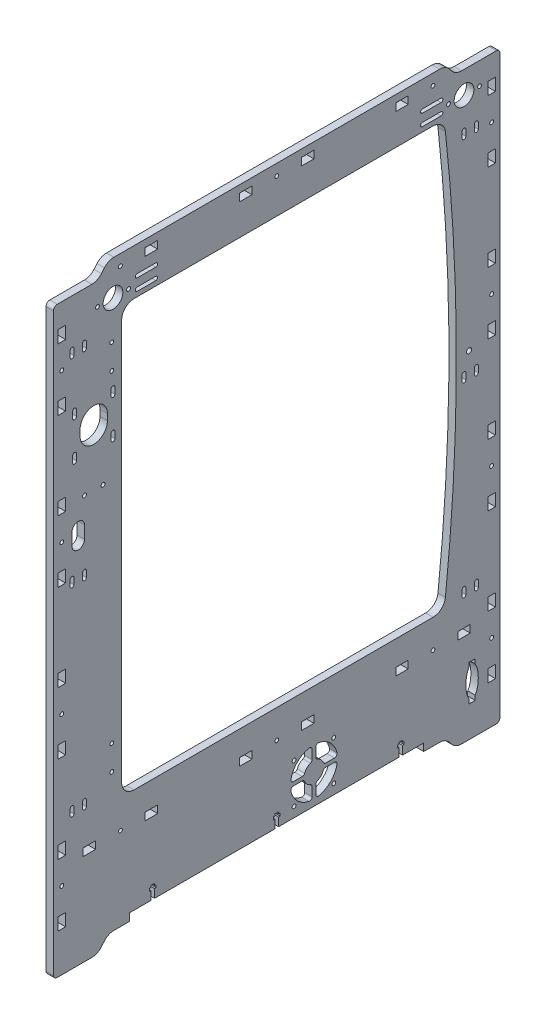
from build123d import *

# Parameters (mm, degrees)
SKETCH_1_R           = 1.55
SKETCH_1_R_2         = 7.95
SKETCH_1_W           = 10
SKETCH_1_H           = 6.1
SKETCH_1_W_2         = 6.1
SKETCH_1_H_2         = 10
EXTRUDE_1_DEPTH      = 6
SKETCH_2_W           = 5
SKETCH_2_H           = 29
CUT_EXTRUDE_1_DEPTH  = 513.675335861
CUT_EXTRUDE_3_DEPTH  = 513.675335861
CUT_EXTRUDE_4_DEPTH  = 513.675335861
SKETCH_7_W           = 237
SKETCH_7_H           = 6
CUT_EXTRUDE_6_DEPTH  = 513.675335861
SKETCH_8_R           = 1.55
CUT_EXTRUDE_7_DEPTH  = 513.675335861
FILLET_2_R           = 2
CUT_EXTRUDE_8_DEPTH  = 513.675335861
CUT_EXTRUDE_9_DEPTH  = 513.675335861
CUT_EXTRUDE_10_DEPTH = 513.675335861
CUT_EXTRUDE_11_DEPTH = 513.675335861
CUT_EXTRUDE_12_DEPTH = 513.675335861
SKETCH_14_RX         = 12.5
SKETCH_14_RY         = 5
CUT_EXTRUDE_13_DEPTH = 513.675335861
SKETCH_15_R          = 1.6
CUT_EXTRUDE_14_DEPTH = 513.675335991
SKETCH_16_R          = 1.55
SKETCH_16_R_2        = 2.05
CUT_EXTRUDE_15_DEPTH = 513.675335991


with BuildPart() as part:
    # Sketch 1 → Extrude 1 (new body)
    with BuildSketch(Plane(origin=(0, 0, 0), x_dir=(0, -1, 0), z_dir=(-1, 0, 0))):
        with BuildLine():
            Line((-473.572123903, -141.339555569), (-476.427876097, -138.943294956))
            ThreePointArc((-476.427876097, -138.943294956), (-479.06307787, -135.509033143), (-480, -131.282850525))
            Line((-480, -131.282850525), (-480, 131.282850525))
            ThreePointArc((-480, 131.282850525), (-479.06307787, 135.509033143), (-476.427876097, 138.943294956))
            Line((-476.427876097, 138.943294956), (-473.572123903, 141.339555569))
            ThreePointArc((-473.572123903, 141.339555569), (-470.93692213, 144.773817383), (-470, 149))
            Line((-470, 149), (-470, 177))
            ThreePointArc((-470, 177), (-469.121320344, 179.121320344), (-467, 180))
            Line((-467, 180), (-3, 180))
            ThreePointArc((-3, 180), (-0.878679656, 179.121320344), (0, 177))
            Line((0, 177), (0, 149))
            ThreePointArc((0, 149), (-0.93692213, 144.773817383), (-3.572123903, 141.339555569))
            Line((-3.572123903, 141.339555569), (-6.427876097, 138.943294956))
            ThreePointArc((-6.427876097, 138.943294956), (-9.06307787, 135.509033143), (-10, 131.282850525))
            Line((-10, 131.282850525), (-10, -131.282850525))
            ThreePointArc((-10, -131.282850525), (-9.06307787, -135.509033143), (-6.427876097, -138.943294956))
            Line((-6.427876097, -138.943294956), (-3.572123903, -141.339555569))
            ThreePointArc((-3.572123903, -141.339555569), (-0.93692213, -144.773817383), (0, -149))
            Line((0, -149), (0, -177))
            ThreePointArc((0, -177), (-0.878679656, -179.121320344), (-3, -180))
            Line((-3, -180), (-467, -180))
            ThreePointArc((-467, -180), (-469.121320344, -179.121320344), (-470, -177))
            Line((-470, -177), (-470, -149))
            ThreePointArc((-470, -149), (-470.93692213, -144.773817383), (-473.572123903, -141.339555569))
        make_face()
        with Locations(Location((-302, 173.25, 0), (0, 0, 90))):
            Circle(SKETCH_1_R, mode=Mode.SUBTRACT)
        with Locations(Location((-62, -173.25, 0), (0, 0, 90))):
            Circle(SKETCH_1_R, mode=Mode.SUBTRACT)
        with Locations(Location((-452, 132, 0), (0, 0, 90))):
            Circle(SKETCH_1_R_2, mode=Mode.SUBTRACT)
        with Locations(Location((-452, 119.5, 0), (0, 0, 90))):
            Circle(SKETCH_1_R, mode=Mode.SUBTRACT)
        with Locations(Location((-182, 173.25, 0), (0, 0, 90))):
            Circle(SKETCH_1_R, mode=Mode.SUBTRACT)
        with Locations(Location((-452, -163.5, 0), (0, 0, 90))):
            Circle(SKETCH_1_R, mode=Mode.SUBTRACT)
        with Locations(Location((-452, -138.5, 0), (0, 0, 90))):
            Circle(SKETCH_1_R, mode=Mode.SUBTRACT)
        with Locations(Location((-452, -151, 0), (0, 0, 90))):
            Circle(SKETCH_1_R_2, mode=Mode.SUBTRACT)
        with Locations(Location((-422, 173.25, 0), (0, 0, 90))):
            Circle(SKETCH_1_R, mode=Mode.SUBTRACT)
        with Locations(Location((-77, 0, 0), (0, 0, 90))):
            Circle(SKETCH_1_R, mode=Mode.SUBTRACT)
        with Locations(Location((-77, 126, 0), (0, 0, 90))):
            Circle(SKETCH_1_R, mode=Mode.SUBTRACT)
        with Locations(Location((-471.1, 126, 0), (0, 0, 90))):
            Circle(SKETCH_1_R, mode=Mode.SUBTRACT)
        with Locations(Location((-471.1, 0, 0), (0, 0, 90))):
            Circle(SKETCH_1_R, mode=Mode.SUBTRACT)
        with Locations(Location((-471.1, -126, 0), (0, 0, 90))):
            Circle(SKETCH_1_R, mode=Mode.SUBTRACT)
        with Locations(Location((-77, -126, 0), (0, 0, 90))):
            Circle(SKETCH_1_R, mode=Mode.SUBTRACT)
        with Locations(Location((-422, -173.25, 0), (0, 0, 90))):
            Circle(SKETCH_1_R, mode=Mode.SUBTRACT)
        with Locations(Location((-182, -173.25, 0), (0, 0, 90))):
            Circle(SKETCH_1_R, mode=Mode.SUBTRACT)
        with Locations(Location((-452, 144.5, 0), (0, 0, 90))):
            Circle(SKETCH_1_R, mode=Mode.SUBTRACT)
        with Locations(Location((-302, -173.25, 0), (0, 0, 90))):
            Circle(SKETCH_1_R, mode=Mode.SUBTRACT)
        with Locations(Location((-62, 173.25, 0), (0, 0, 90))):
            Circle(SKETCH_1_R, mode=Mode.SUBTRACT)
        with Locations((-37, -173.25)):
            Rectangle(SKETCH_1_W, SKETCH_1_H, mode=Mode.SUBTRACT)
        with Locations((-397, 173.25)):
            Rectangle(SKETCH_1_W, SKETCH_1_H, mode=Mode.SUBTRACT)
        with Locations((-327, 173.25)):
            Rectangle(SKETCH_1_W, SKETCH_1_H, mode=Mode.SUBTRACT)
        with Locations((-277, 173.25)):
            Rectangle(SKETCH_1_W, SKETCH_1_H, mode=Mode.SUBTRACT)
        with Locations((-207, 173.25)):
            Rectangle(SKETCH_1_W, SKETCH_1_H, mode=Mode.SUBTRACT)
        with Locations((-157, 173.25)):
            Rectangle(SKETCH_1_W, SKETCH_1_H, mode=Mode.SUBTRACT)
        with Locations((-471.1, -25)):
            Rectangle(SKETCH_1_W_2, SKETCH_1_H_2, mode=Mode.SUBTRACT)
        with Locations((-447, 173.25)):
            Rectangle(SKETCH_1_W, SKETCH_1_H, mode=Mode.SUBTRACT)
        with Locations((-471.1, -101)):
            Rectangle(SKETCH_1_W_2, SKETCH_1_H_2, mode=Mode.SUBTRACT)
        with Locations((-77, -151)):
            Rectangle(SKETCH_1_W_2, SKETCH_1_H_2, mode=Mode.SUBTRACT)
        with Locations((-77, -101)):
            Rectangle(SKETCH_1_W_2, SKETCH_1_H_2, mode=Mode.SUBTRACT)
        with Locations((-77, -25)):
            Rectangle(SKETCH_1_W_2, SKETCH_1_H_2, mode=Mode.SUBTRACT)
        with Locations((-447, -173.25)):
            Rectangle(SKETCH_1_W, SKETCH_1_H, mode=Mode.SUBTRACT)
        with Locations((-157, -173.25)):
            Rectangle(SKETCH_1_W, SKETCH_1_H, mode=Mode.SUBTRACT)
        with Locations((-207, -173.25)):
            Rectangle(SKETCH_1_W, SKETCH_1_H, mode=Mode.SUBTRACT)
        with Locations((-277, -173.25)):
            Rectangle(SKETCH_1_W, SKETCH_1_H, mode=Mode.SUBTRACT)
        with Locations((-77, 25)):
            Rectangle(SKETCH_1_W_2, SKETCH_1_H_2, mode=Mode.SUBTRACT)
        with Locations((-77, 101)):
            Rectangle(SKETCH_1_W_2, SKETCH_1_H_2, mode=Mode.SUBTRACT)
        with Locations((-77, 151)):
            Rectangle(SKETCH_1_W_2, SKETCH_1_H_2, mode=Mode.SUBTRACT)
        with Locations((-471.1, 101)):
            Rectangle(SKETCH_1_W_2, SKETCH_1_H_2, mode=Mode.SUBTRACT)
        with Locations((-327, -173.25)):
            Rectangle(SKETCH_1_W, SKETCH_1_H, mode=Mode.SUBTRACT)
        with Locations((-471.1, 25)):
            Rectangle(SKETCH_1_W_2, SKETCH_1_H_2, mode=Mode.SUBTRACT)
        with Locations((-397, -173.25)):
            Rectangle(SKETCH_1_W, SKETCH_1_H, mode=Mode.SUBTRACT)
        with Locations((-87, 173.25)):
            Rectangle(SKETCH_1_W, SKETCH_1_H, mode=Mode.SUBTRACT)
        with Locations((-37, 173.25)):
            Rectangle(SKETCH_1_W, SKETCH_1_H, mode=Mode.SUBTRACT)
        with Locations((-87, -173.25)):
            Rectangle(SKETCH_1_W, SKETCH_1_H, mode=Mode.SUBTRACT)
    extrude(amount=-EXTRUDE_1_DEPTH)

    # Sketch 2 → Cut-Extrude 1 (cut, through all)
    with BuildSketch(Plane.ZY):
        with Locations((-157.5, 39.5)):
            Rectangle(SKETCH_2_W, SKETCH_2_H)
    extrude(amount=-CUT_EXTRUDE_1_DEPTH, mode=Mode.SUBTRACT)

    # Sketch 4 → Cut-Extrude 3 (cut, through all)
    with BuildSketch(Plane(origin=(6, 0, 0), x_dir=(0, 0, -1), z_dir=(1, 0, 0))):
        with BuildLine():
            Line((-115, 443), (126.058043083, 443))
            ThreePointArc((126.058043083, 443), (132.734908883, 440.444424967), (135.999128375, 434.083892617))
            ThreePointArc((135.999128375, 434.083892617), (144.836334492, 271.5), (135.999128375, 108.916107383))
            ThreePointArc((135.999128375, 108.916107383), (132.734908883, 102.555575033), (126.058043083, 100))
            Line((126.058043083, 100), (-115, 100))
            ThreePointArc((-115, 100), (-122.071067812, 102.928932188), (-125, 110))
            Line((-125, 110), (-125, 433))
            ThreePointArc((-125, 433), (-122.071067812, 440.071067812), (-115, 443))
        make_face()
    extrude(amount=-CUT_EXTRUDE_3_DEPTH, mode=Mode.SUBTRACT)

    # Sketch 5 → Cut-Extrude 4 (cut, through all)
    with BuildSketch(Plane(origin=(6, 0, 0), x_dir=(0, 0, -1), z_dir=(1, 0, 0))):
        with BuildLine():
            Line((-136.5, 373.5), (-136.5, 368.5))
            ThreePointArc((-136.5, 368.5), (-147.5, 357.5), (-158.5, 368.5))
            Line((-158.5, 368.5), (-158.5, 373.5))
            ThreePointArc((-158.5, 373.5), (-147.5, 384.5), (-136.5, 373.5))
        make_face()
        with BuildLine():
            Line((-164.55, 384), (-164.55, 389))
            ThreePointArc((-164.55, 389), (-163, 390.55), (-161.45, 389))
            Line((-161.45, 389), (-161.45, 384))
            ThreePointArc((-161.45, 384), (-163, 382.45), (-164.55, 384))
        make_face()
        with BuildLine():
            Line((-133.55, 384), (-133.55, 389))
            ThreePointArc((-133.55, 389), (-132, 390.55), (-130.45, 389))
            Line((-130.45, 389), (-130.45, 384))
            ThreePointArc((-130.45, 384), (-132, 382.45), (-133.55, 384))
        make_face()
        with BuildLine():
            Line((-161.45, 358), (-161.45, 353))
            ThreePointArc((-161.45, 353), (-163, 351.45), (-164.55, 353))
            Line((-164.55, 353), (-164.55, 358))
            ThreePointArc((-164.55, 358), (-163, 359.55), (-161.45, 358))
        make_face()
        with BuildLine():
            Line((-130.45, 358), (-130.45, 353))
            ThreePointArc((-130.45, 353), (-132, 351.45), (-133.55, 353))
            Line((-133.55, 353), (-133.55, 358))
            ThreePointArc((-133.55, 358), (-132, 359.55), (-130.45, 358))
        make_face()
    extrude(amount=-CUT_EXTRUDE_4_DEPTH, mode=Mode.SUBTRACT)

    # Sketch 7 → Cut-Extrude 6 (cut, through all)
    with BuildSketch(Plane(origin=(6, 0, 0), x_dir=(0, 0, -1), z_dir=(1, 0, 0))):
        with Locations((0, 13)):
            Rectangle(SKETCH_7_W, SKETCH_7_H)
    extrude(amount=-CUT_EXTRUDE_6_DEPTH, mode=Mode.SUBTRACT)

    # Sketch 8 → Cut-Extrude 7 (cut, through all)
    with BuildSketch(Plane(origin=(6, 0, 0), x_dir=(0, 0, -1), z_dir=(1, 0, 0))):
        with Locations((14, 56)):
            Circle(SKETCH_8_R)
        with Locations((46, 56)):
            Circle(SKETCH_8_R)
        with Locations((46, 24)):
            Circle(SKETCH_8_R)
        with Locations((14, 24)):
            Circle(SKETCH_8_R)
        with BuildLine():
            Line((28.5, 58.940696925), (28.5, 47.858116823))
            ThreePointArc((28.5, 47.858116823), (24.343145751, 45.656854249), (22.141883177, 41.5))
            Line((22.141883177, 41.5), (11.059303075, 41.5))
            ThreePointArc((11.059303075, 41.5), (16.564971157, 53.435028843), (28.5, 58.940696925))
        make_face()
        with BuildLine():
            Line((31.5, 58.940696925), (31.5, 47.858116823))
            ThreePointArc((31.5, 47.858116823), (35.656854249, 45.656854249), (37.858116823, 41.5))
            Line((37.858116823, 41.5), (48.940696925, 41.5))
            ThreePointArc((48.940696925, 41.5), (43.435028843, 53.435028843), (31.5, 58.940696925))
        make_face()
        with BuildLine():
            Line((48.940696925, 38.5), (37.858116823, 38.5))
            ThreePointArc((37.858116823, 38.5), (35.656854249, 34.343145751), (31.5, 32.141883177))
            Line((31.5, 32.141883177), (31.5, 21.059303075))
            ThreePointArc((31.5, 21.059303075), (43.435028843, 26.564971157), (48.940696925, 38.5))
        make_face()
        with BuildLine():
            Line((28.5, 21.059303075), (28.5, 32.141883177))
            ThreePointArc((28.5, 32.141883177), (24.343145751, 34.343145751), (22.141883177, 38.5))
            Line((22.141883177, 38.5), (11.059303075, 38.5))
            ThreePointArc((11.059303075, 38.5), (16.564971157, 26.564971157), (28.5, 21.059303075))
        make_face()
    extrude(amount=-CUT_EXTRUDE_7_DEPTH, mode=Mode.SUBTRACT)

    # Fillet 2
    fillet_2_edges = [part.edges().sort_by_distance(p)[0] for p in [
        (3, 58.940696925, -31.5),
        (3, 41.5, -48.940696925),
        (3, 41.5, -37.858116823),
        (3, 47.858116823, -31.5),
        (3, 21.059303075, -28.5),
        (3, 38.5, -11.059303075),
        (3, 38.5, -22.141883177),
        (3, 32.141883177, -28.5),
        (3, 41.5, -11.059303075),
        (3, 58.940696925, -28.5),
        (3, 47.858116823, -28.5),
        (3, 41.5, -22.141883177),
        (3, 38.5, -48.940696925),
        (3, 21.059303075, -31.5),
        (3, 32.141883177, -31.5),
        (3, 38.5, -37.858116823),
    ]]
    fillet(fillet_2_edges, radius=FILLET_2_R)

    # Sketch 9 → Cut-Extrude 8 (cut, through all)
    with BuildSketch(Plane(origin=(6, 0, 0), x_dir=(0, 0, -1), z_dir=(1, 0, 0))):
        with BuildLine():
            Line((-155, 305), (-155, 295))
            ThreePointArc((-155, 295), (-160, 290), (-165, 295))
            Line((-165, 295), (-165, 305))
            ThreePointArc((-165, 305), (-160, 310), (-155, 305))
        make_face()
    extrude(amount=-CUT_EXTRUDE_8_DEPTH, mode=Mode.SUBTRACT)

    # Sketch 10 → Cut-Extrude 9 (cut, through all)
    with BuildSketch(Plane(origin=(6, 0, 0), x_dir=(0, 0, -1), z_dir=(1, 0, 0))):
        Polygon((-1.5, 16), (1.5, 16), (1.5, 22.8), (2.75, 22.8), (2.75, 25), (1.5, 25), (1.5, 26.5), (-1.5, 26.5), (-1.5, 25), (-2.75, 25), (-2.75, 22.8), (-1.5, 22.8), align=None)
        Polygon((101.5, 26.5), (98.5, 26.5), (98.5, 25), (97.25, 25), (97.25, 22.8), (98.5, 22.8), (98.5, 16), (101.5, 16), (101.5, 22.8), (102.75, 22.8), (102.75, 25), (101.5, 25), align=None)
        Polygon((-98.5, 16), (-101.5, 16), (-101.5, 22.8), (-102.75, 22.8), (-102.75, 25), (-101.5, 25), (-101.5, 26.5), (-98.5, 26.5), (-98.5, 25), (-97.25, 25), (-97.25, 22.8), (-98.5, 22.8), align=None)
    extrude(amount=-CUT_EXTRUDE_9_DEPTH, mode=Mode.SUBTRACT)

    # Sketch 11 → Cut-Extrude 10 (cut, through all)
    with BuildSketch(Plane(origin=(6, 0, 0), x_dir=(0, 0, -1), z_dir=(1, 0, 0))):
        with BuildLine():
            Line((-112.5, 459.2), (-97.5, 459.2))
            ThreePointArc((-97.5, 459.2), (-96, 457.7), (-97.5, 456.2))
            Line((-97.5, 456.2), (-112.5, 456.2))
            ThreePointArc((-112.5, 456.2), (-114, 457.7), (-112.5, 459.2))
        make_face()
        with BuildLine():
            Line((-112.5, 446.8), (-97.5, 446.8))
            ThreePointArc((-97.5, 446.8), (-96, 448.3), (-97.5, 449.8))
            Line((-97.5, 449.8), (-112.5, 449.8))
            ThreePointArc((-112.5, 449.8), (-114, 448.3), (-112.5, 446.8))
        make_face()
        with BuildLine():
            Line((132.5, 446.8), (117.5, 446.8))
            ThreePointArc((117.5, 446.8), (116, 448.3), (117.5, 449.8))
            Line((117.5, 449.8), (132.5, 449.8))
            ThreePointArc((132.5, 449.8), (134, 448.3), (132.5, 446.8))
        make_face()
        with BuildLine():
            Line((132.5, 459.2), (117.5, 459.2))
            ThreePointArc((117.5, 459.2), (116, 457.7), (117.5, 456.2))
            Line((117.5, 456.2), (132.5, 456.2))
            ThreePointArc((132.5, 456.2), (134, 457.7), (132.5, 459.2))
        make_face()
    extrude(amount=-CUT_EXTRUDE_10_DEPTH, mode=Mode.SUBTRACT)

    # Sketch 12 → Cut-Extrude 11 (cut, through all)
    with BuildSketch(Plane(origin=(6, 0, 0), x_dir=(0, 0, -1), z_dir=(1, 0, 0))):
        with BuildLine():
            Line((152.5, 427.5), (152.5, 422.5))
            ThreePointArc((152.5, 422.5), (151, 421), (149.5, 422.5))
            Line((149.5, 422.5), (149.5, 427.5))
            ThreePointArc((149.5, 427.5), (151, 429), (152.5, 427.5))
        make_face()
        with BuildLine():
            Line((159.5, 427.5), (159.5, 422.5))
            ThreePointArc((159.5, 422.5), (161, 421), (162.5, 422.5))
            Line((162.5, 422.5), (162.5, 427.5))
            ThreePointArc((162.5, 427.5), (161, 429), (159.5, 427.5))
        make_face()
        with BuildLine():
            Line((152.5, 257.5), (152.5, 252.5))
            ThreePointArc((152.5, 252.5), (151, 251), (149.5, 252.5))
            Line((149.5, 252.5), (149.5, 257.5))
            ThreePointArc((149.5, 257.5), (151, 259), (152.5, 257.5))
        make_face()
        with BuildLine():
            Line((159.5, 257.5), (159.5, 252.5))
            ThreePointArc((159.5, 252.5), (161, 251), (162.5, 252.5))
            Line((162.5, 252.5), (162.5, 257.5))
            ThreePointArc((162.5, 257.5), (161, 259), (159.5, 257.5))
        make_face()
        with BuildLine():
            Line((152.5, 107.5), (152.5, 102.5))
            ThreePointArc((152.5, 102.5), (151, 101), (149.5, 102.5))
            Line((149.5, 102.5), (149.5, 107.5))
            ThreePointArc((149.5, 107.5), (151, 109), (152.5, 107.5))
        make_face()
        with BuildLine():
            Line((159.5, 107.5), (159.5, 102.5))
            ThreePointArc((159.5, 102.5), (161, 101), (162.5, 102.5))
            Line((162.5, 102.5), (162.5, 107.5))
            ThreePointArc((162.5, 107.5), (161, 109), (159.5, 107.5))
        make_face()
    extrude(amount=-CUT_EXTRUDE_11_DEPTH, mode=Mode.SUBTRACT)

    # Sketch 13 → Cut-Extrude 12 (cut, through all)
    with BuildSketch(Plane(origin=(6, 0, 0), x_dir=(0, 0, -1), z_dir=(1, 0, 0))):
        with BuildLine():
            Line((-163.5, 432.5), (-163.5, 427.5))
            ThreePointArc((-163.5, 427.5), (-165, 426), (-166.5, 427.5))
            Line((-166.5, 427.5), (-166.5, 432.5))
            ThreePointArc((-166.5, 432.5), (-165, 434), (-163.5, 432.5))
        make_face()
        with BuildLine():
            Line((-156.5, 432.5), (-156.5, 427.5))
            ThreePointArc((-156.5, 427.5), (-155, 426), (-153.5, 427.5))
            Line((-153.5, 427.5), (-153.5, 432.5))
            ThreePointArc((-153.5, 432.5), (-155, 434), (-156.5, 432.5))
        make_face()
        with BuildLine():
            Line((-163.5, 272.5), (-163.5, 267.5))
            ThreePointArc((-163.5, 267.5), (-165, 266), (-166.5, 267.5))
            Line((-166.5, 267.5), (-166.5, 272.5))
            ThreePointArc((-166.5, 272.5), (-165, 274), (-163.5, 272.5))
        make_face()
        with BuildLine():
            Line((-156.5, 272.5), (-156.5, 267.5))
            ThreePointArc((-156.5, 267.5), (-155, 266), (-153.5, 267.5))
            Line((-153.5, 267.5), (-153.5, 272.5))
            ThreePointArc((-153.5, 272.5), (-155, 274), (-156.5, 272.5))
        make_face()
        with BuildLine():
            Line((-163.5, 112.5), (-163.5, 107.5))
            ThreePointArc((-163.5, 107.5), (-165, 106), (-166.5, 107.5))
            Line((-166.5, 107.5), (-166.5, 112.5))
            ThreePointArc((-166.5, 112.5), (-165, 114), (-163.5, 112.5))
        make_face()
        with BuildLine():
            Line((-156.5, 112.5), (-156.5, 107.5))
            ThreePointArc((-156.5, 107.5), (-155, 106), (-153.5, 107.5))
            Line((-153.5, 107.5), (-153.5, 112.5))
            ThreePointArc((-153.5, 112.5), (-155, 114), (-156.5, 112.5))
        make_face()
    extrude(amount=-CUT_EXTRUDE_12_DEPTH, mode=Mode.SUBTRACT)

    # Sketch 14 → Cut-Extrude 13 (cut, through all)
    with BuildSketch(Plane(origin=(6, 0, 0), x_dir=(0, 0, -1), z_dir=(1, 0, 0))):
        with Locations(Location((157.5, 39.5), (0, 0, -90))):
            Ellipse(SKETCH_14_RX, SKETCH_14_RY)
    extrude(amount=-CUT_EXTRUDE_13_DEPTH, mode=Mode.SUBTRACT)

    # Sketch 15 → Cut-Extrude 14 (cut, through all)
    with BuildSketch(Plane(origin=(6, 0, 0), x_dir=(0, 0, -1), z_dir=(1, 0, 0))):
        with Locations((-140, 325.5)):
            Circle(SKETCH_15_R)
        with Locations((-155, 325.5)):
            Circle(SKETCH_15_R)
    extrude(amount=-CUT_EXTRUDE_14_DEPTH, mode=Mode.SUBTRACT)

    # Sketch 16 → Cut-Extrude 15 (cut, through all)
    with BuildSketch(Plane(origin=(6, 0, 0), x_dir=(0, 0, -1), z_dir=(1, 0, 0))):
        with Locations((-133, 421.5)):
            Circle(SKETCH_16_R)
        with Locations((-133, 401.5)):
            Circle(SKETCH_16_R)
        with Locations((-133, 141.5)):
            Circle(SKETCH_16_R)
        with Locations((-133, 121.5)):
            Circle(SKETCH_16_R)
        with Locations((155, 271.5)):
            Circle(SKETCH_16_R_2)
    extrude(amount=-CUT_EXTRUDE_15_DEPTH, mode=Mode.SUBTRACT)


solid = part.part
